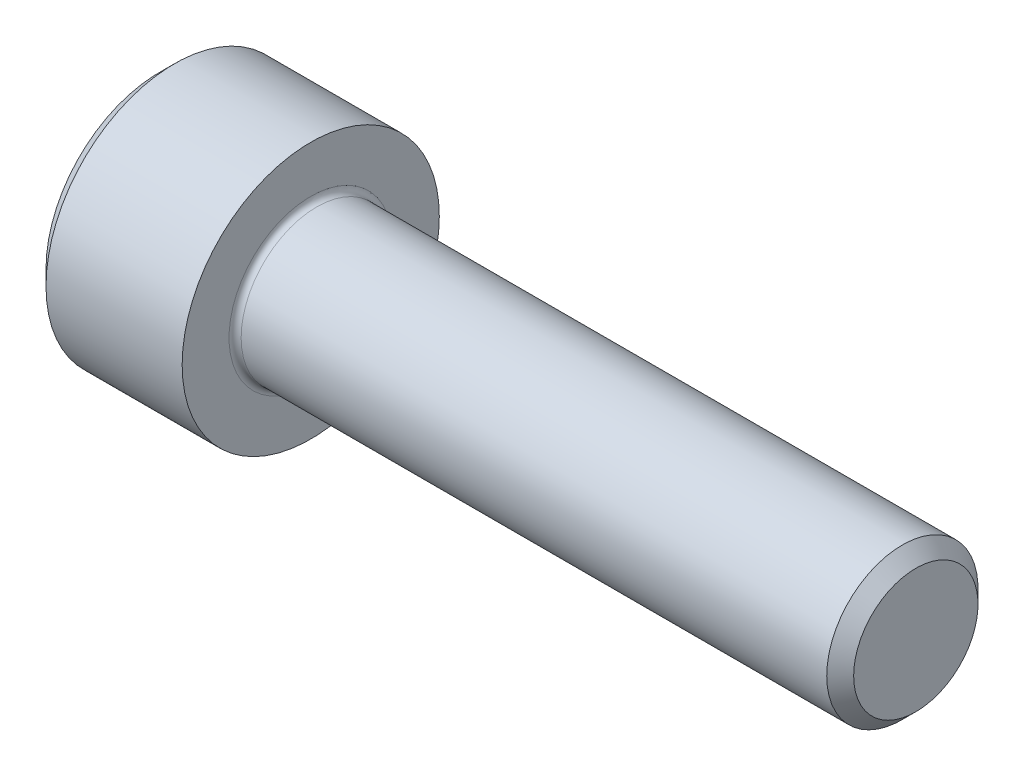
ISO-10303-21;
HEADER;
FILE_DESCRIPTION(('STEP AP214'),'2;1');
FILE_NAME('part.step','',(''),(''),'','','');
FILE_SCHEMA(('AUTOMOTIVE_DESIGN { 1 0 10303 214 1 1 1 1 }'));
ENDSEC;
DATA;
#1=APPLICATION_CONTEXT('core data for automotive mechanical design processes');
#2=APPLICATION_PROTOCOL_DEFINITION('international standard','automotive_design',2000,#1);
#3=PRODUCT_CONTEXT('',#1,'mechanical');
#4=PRODUCT('Part','Part','',(#3));
#5=PRODUCT_RELATED_PRODUCT_CATEGORY('part','',(#4));
#6=PRODUCT_DEFINITION_FORMATION('','',#4);
#7=PRODUCT_DEFINITION_CONTEXT('part definition',#1,'design');
#8=PRODUCT_DEFINITION('design','',#6,#7);
#9=PRODUCT_DEFINITION_SHAPE('','',#8);
#10=(LENGTH_UNIT() NAMED_UNIT(*) SI_UNIT(.MILLI.,.METRE.));
#11=(NAMED_UNIT(*) PLANE_ANGLE_UNIT() SI_UNIT($,.RADIAN.));
#12=(NAMED_UNIT(*) SI_UNIT($,.STERADIAN.) SOLID_ANGLE_UNIT());
#13=UNCERTAINTY_MEASURE_WITH_UNIT(LENGTH_MEASURE(1.E-05),#10,'distance_accuracy_value','');
#14=(GEOMETRIC_REPRESENTATION_CONTEXT(3) GLOBAL_UNCERTAINTY_ASSIGNED_CONTEXT((#13)) GLOBAL_UNIT_ASSIGNED_CONTEXT((#10,
#11,#12)) REPRESENTATION_CONTEXT('',''));
#15=CARTESIAN_POINT('',(0.,0.,0.));
#16=DIRECTION('',(0.,0.,1.));
#17=DIRECTION('',(1.,0.,0.));
#18=AXIS2_PLACEMENT_3D('',#15,#16,#17);
#19=CARTESIAN_POINT('',(0.,0.,0.));
#20=DIRECTION('',(-1.,0.,0.));
#21=DIRECTION('',(0.,0.,1.));
#22=AXIS2_PLACEMENT_3D('',#19,#20,#21);
#23=PLANE('',#22);
#24=DIRECTION('',(0.,-0.499999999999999,0.866025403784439));
#25=VECTOR('',#24,1.);
#26=CARTESIAN_POINT('',(0.,2.35789849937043,0.));
#27=LINE('',#26,#25);
#28=CARTESIAN_POINT('',(0.,2.35789849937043,0.));
#29=VERTEX_POINT('',#28);
#30=CARTESIAN_POINT('',(0.,1.17894924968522,2.042));
#31=VERTEX_POINT('',#30);
#32=EDGE_CURVE('E112',#29,#31,#27,.T.);
#33=ORIENTED_EDGE('',*,*,#32,.T.);
#34=DIRECTION('',(0.,1.,0.));
#35=VECTOR('',#34,1.);
#36=CARTESIAN_POINT('',(0.,-1.17894924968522,2.042));
#37=LINE('',#36,#35);
#38=CARTESIAN_POINT('',(0.,-1.17894924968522,2.042));
#39=VERTEX_POINT('',#38);
#40=EDGE_CURVE('E101',#39,#31,#37,.T.);
#41=ORIENTED_EDGE('',*,*,#40,.F.);
#42=DIRECTION('',(0.,-0.500000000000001,-0.866025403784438));
#43=VECTOR('',#42,1.);
#44=CARTESIAN_POINT('',(0.,-1.17894924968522,2.042));
#45=LINE('',#44,#43);
#46=CARTESIAN_POINT('',(0.,-2.35789849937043,0.));
#47=VERTEX_POINT('',#46);
#48=EDGE_CURVE('E111',#39,#47,#45,.T.);
#49=ORIENTED_EDGE('',*,*,#48,.T.);
#50=DIRECTION('',(0.,0.499999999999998,-0.86602540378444));
#51=VECTOR('',#50,1.);
#52=CARTESIAN_POINT('',(0.,-2.35789849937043,0.));
#53=LINE('',#52,#51);
#54=CARTESIAN_POINT('',(0.,-1.17894924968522,-2.042));
#55=VERTEX_POINT('',#54);
#56=EDGE_CURVE('E130',#47,#55,#53,.T.);
#57=ORIENTED_EDGE('',*,*,#56,.T.);
#58=DIRECTION('',(0.,-1.,0.));
#59=VECTOR('',#58,1.);
#60=CARTESIAN_POINT('',(0.,1.17894924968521,-2.042));
#61=LINE('',#60,#59);
#62=CARTESIAN_POINT('',(0.,1.17894924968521,-2.042));
#63=VERTEX_POINT('',#62);
#64=EDGE_CURVE('E133',#63,#55,#61,.T.);
#65=ORIENTED_EDGE('',*,*,#64,.F.);
#66=DIRECTION('',(0.,-0.500000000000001,-0.866025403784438));
#67=VECTOR('',#66,1.);
#68=CARTESIAN_POINT('',(0.,2.35789849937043,0.));
#69=LINE('',#68,#67);
#70=EDGE_CURVE('E126',#29,#63,#69,.T.);
#71=ORIENTED_EDGE('',*,*,#70,.F.);
#72=EDGE_LOOP('',(#33,#41,#49,#57,#65,#71));
#73=FACE_BOUND('',#72,.T.);
#74=CARTESIAN_POINT('',(0.,0.,0.));
#75=DIRECTION('',(-1.,0.,0.));
#76=DIRECTION('',(0.,0.,1.));
#77=AXIS2_PLACEMENT_3D('',#74,#75,#76);
#78=CIRCLE('',#77,3.75);
#79=CARTESIAN_POINT('',(0.,0.,3.75));
#80=VERTEX_POINT('',#79);
#81=EDGE_CURVE('E184',#80,#80,#78,.T.);
#82=ORIENTED_EDGE('',*,*,#81,.T.);
#83=EDGE_LOOP('',(#82));
#84=FACE_BOUND('',#83,.T.);
#85=ADVANCED_FACE('F30',(#73,#84),#23,.T.);
#86=CARTESIAN_POINT('',(0.,0.,0.));
#87=DIRECTION('',(1.,0.,0.));
#88=DIRECTION('',(0.,0.,-1.));
#89=AXIS2_PLACEMENT_3D('',#86,#87,#88);
#90=CONICAL_SURFACE('',#89,3.75,0.785398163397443);
#91=CARTESIAN_POINT('',(0.5,0.,0.));
#92=DIRECTION('',(-1.,0.,0.));
#93=DIRECTION('',(0.,0.,1.));
#94=AXIS2_PLACEMENT_3D('',#91,#92,#93);
#95=CIRCLE('',#94,4.25);
#96=CARTESIAN_POINT('',(0.5,0.,4.25));
#97=VERTEX_POINT('',#96);
#98=EDGE_CURVE('E181',#97,#97,#95,.T.);
#99=ORIENTED_EDGE('',*,*,#98,.T.);
#100=EDGE_LOOP('',(#99));
#101=FACE_BOUND('',#100,.T.);
#102=ORIENTED_EDGE('',*,*,#81,.F.);
#103=EDGE_LOOP('',(#102));
#104=FACE_BOUND('',#103,.T.);
#105=ADVANCED_FACE('F208',(#101,#104),#90,.T.);
#106=CARTESIAN_POINT('',(-31.75,0.,0.));
#107=DIRECTION('',(-1.,0.,0.));
#108=DIRECTION('',(0.,0.,1.));
#109=AXIS2_PLACEMENT_3D('',#106,#107,#108);
#110=CYLINDRICAL_SURFACE('',#109,4.25);
#111=CARTESIAN_POINT('',(5.,0.,0.));
#112=DIRECTION('',(-1.,0.,0.));
#113=DIRECTION('',(0.,0.,1.));
#114=AXIS2_PLACEMENT_3D('',#111,#112,#113);
#115=CIRCLE('',#114,4.25);
#116=CARTESIAN_POINT('',(5.,0.,4.25));
#117=VERTEX_POINT('',#116);
#118=EDGE_CURVE('E178',#117,#117,#115,.T.);
#119=ORIENTED_EDGE('',*,*,#118,.T.);
#120=EDGE_LOOP('',(#119));
#121=FACE_BOUND('',#120,.T.);
#122=ORIENTED_EDGE('',*,*,#98,.F.);
#123=EDGE_LOOP('',(#122));
#124=FACE_BOUND('',#123,.T.);
#125=ADVANCED_FACE('F212',(#121,#124),#110,.T.);
#126=CARTESIAN_POINT('',(5.,4.25,0.));
#127=DIRECTION('',(1.,0.,0.));
#128=DIRECTION('',(0.,0.,-1.));
#129=AXIS2_PLACEMENT_3D('',#126,#127,#128);
#130=PLANE('',#129);
#131=CARTESIAN_POINT('',(5.,0.,0.));
#132=DIRECTION('',(1.,0.,0.));
#133=DIRECTION('',(0.,0.,-1.));
#134=AXIS2_PLACEMENT_3D('',#131,#132,#133);
#135=CIRCLE('',#134,2.7);
#136=CARTESIAN_POINT('',(5.,0.,-2.7));
#137=VERTEX_POINT('',#136);
#138=EDGE_CURVE('E37',#137,#137,#135,.F.);
#139=ORIENTED_EDGE('',*,*,#138,.T.);
#140=EDGE_LOOP('',(#139));
#141=FACE_BOUND('',#140,.T.);
#142=ORIENTED_EDGE('',*,*,#118,.F.);
#143=EDGE_LOOP('',(#142));
#144=FACE_BOUND('',#143,.T.);
#145=ADVANCED_FACE('F189',(#141,#144),#130,.T.);
#146=CARTESIAN_POINT('',(-31.75,0.,0.));
#147=DIRECTION('',(-1.,0.,0.));
#148=DIRECTION('',(0.,0.,1.));
#149=AXIS2_PLACEMENT_3D('',#146,#147,#148);
#150=CYLINDRICAL_SURFACE('',#149,2.5);
#151=CARTESIAN_POINT('',(5.2,0.,0.));
#152=DIRECTION('',(1.,0.,0.));
#153=DIRECTION('',(0.,0.,-1.));
#154=AXIS2_PLACEMENT_3D('',#151,#152,#153);
#155=CIRCLE('',#154,2.5);
#156=CARTESIAN_POINT('',(5.2,0.,-2.5));
#157=VERTEX_POINT('',#156);
#158=EDGE_CURVE('E11',#157,#157,#155,.T.);
#159=ORIENTED_EDGE('',*,*,#158,.T.);
#160=EDGE_LOOP('',(#159));
#161=FACE_BOUND('',#160,.T.);
#162=CARTESIAN_POINT('',(24.555,0.,0.));
#163=DIRECTION('',(-1.,0.,0.));
#164=DIRECTION('',(0.,0.,1.));
#165=AXIS2_PLACEMENT_3D('',#162,#163,#164);
#166=CIRCLE('',#165,2.5);
#167=CARTESIAN_POINT('',(24.555,0.,2.5));
#168=VERTEX_POINT('',#167);
#169=EDGE_CURVE('E175',#168,#168,#166,.T.);
#170=ORIENTED_EDGE('',*,*,#169,.T.);
#171=EDGE_LOOP('',(#170));
#172=FACE_BOUND('',#171,.T.);
#173=ADVANCED_FACE('F223',(#161,#172),#150,.T.);
#174=CARTESIAN_POINT('',(25.,0.,0.));
#175=DIRECTION('',(-1.,0.,0.));
#176=DIRECTION('',(0.,0.,1.));
#177=AXIS2_PLACEMENT_3D('',#174,#175,#176);
#178=CONICAL_SURFACE('',#177,2.055,0.785398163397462);
#179=ORIENTED_EDGE('',*,*,#169,.F.);
#180=EDGE_LOOP('',(#179));
#181=FACE_BOUND('',#180,.T.);
#182=CARTESIAN_POINT('',(25.,0.,0.));
#183=DIRECTION('',(-1.,0.,0.));
#184=DIRECTION('',(0.,0.,1.));
#185=AXIS2_PLACEMENT_3D('',#182,#183,#184);
#186=CIRCLE('',#185,2.055);
#187=CARTESIAN_POINT('',(25.,0.,2.055));
#188=VERTEX_POINT('',#187);
#189=EDGE_CURVE('E171',#188,#188,#186,.T.);
#190=ORIENTED_EDGE('',*,*,#189,.T.);
#191=EDGE_LOOP('',(#190));
#192=FACE_BOUND('',#191,.T.);
#193=ADVANCED_FACE('F202',(#181,#192),#178,.T.);
#194=CARTESIAN_POINT('',(25.,2.055,0.));
#195=DIRECTION('',(1.,0.,0.));
#196=DIRECTION('',(0.,0.,-1.));
#197=AXIS2_PLACEMENT_3D('',#194,#195,#196);
#198=PLANE('',#197);
#199=ORIENTED_EDGE('',*,*,#189,.F.);
#200=EDGE_LOOP('',(#199));
#201=FACE_BOUND('',#200,.T.);
#202=ADVANCED_FACE('F194',(#201),#198,.T.);
#203=CARTESIAN_POINT('',(5.2,0.,0.));
#204=DIRECTION('',(1.,0.,0.));
#205=DIRECTION('',(0.,0.,-1.));
#206=AXIS2_PLACEMENT_3D('',#203,#204,#205);
#207=TOROIDAL_SURFACE('',#206,2.7,0.2);
#208=ORIENTED_EDGE('',*,*,#158,.F.);
#209=EDGE_LOOP('',(#208));
#210=FACE_BOUND('',#209,.T.);
#211=ORIENTED_EDGE('',*,*,#138,.F.);
#212=EDGE_LOOP('',(#211));
#213=FACE_BOUND('',#212,.T.);
#214=ADVANCED_FACE('F192',(#210,#213),#207,.F.);
#215=CARTESIAN_POINT('',(2.5,2.35789849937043,0.));
#216=DIRECTION('',(0.,-0.866025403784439,-0.499999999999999));
#217=DIRECTION('',(0.,0.499999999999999,-0.866025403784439));
#218=AXIS2_PLACEMENT_3D('',#215,#216,#217);
#219=PLANE('',#218);
#220=ORIENTED_EDGE('',*,*,#32,.F.);
#221=DIRECTION('',(-1.,0.,0.));
#222=VECTOR('',#221,1.);
#223=CARTESIAN_POINT('',(2.5,2.35789849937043,0.));
#224=LINE('',#223,#222);
#225=CARTESIAN_POINT('',(2.5,2.35789849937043,0.));
#226=VERTEX_POINT('',#225);
#227=EDGE_CURVE('E156',#226,#29,#224,.T.);
#228=ORIENTED_EDGE('',*,*,#227,.F.);
#229=DIRECTION('',(0.,-0.499999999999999,0.866025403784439));
#230=VECTOR('',#229,1.);
#231=CARTESIAN_POINT('',(2.5,2.35789849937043,0.));
#232=LINE('',#231,#230);
#233=CARTESIAN_POINT('',(2.5,1.76842387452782,1.021));
#234=VERTEX_POINT('',#233);
#235=EDGE_CURVE('E136',#226,#234,#232,.T.);
#236=ORIENTED_EDGE('',*,*,#235,.T.);
#237=CARTESIAN_POINT('',(2.5,1.17894924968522,2.042));
#238=VERTEX_POINT('',#237);
#239=EDGE_CURVE('E120',#234,#238,#232,.T.);
#240=ORIENTED_EDGE('',*,*,#239,.T.);
#241=DIRECTION('',(-1.,0.,0.));
#242=VECTOR('',#241,1.);
#243=CARTESIAN_POINT('',(2.5,1.17894924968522,2.042));
#244=LINE('',#243,#242);
#245=EDGE_CURVE('E105',#238,#31,#244,.T.);
#246=ORIENTED_EDGE('',*,*,#245,.T.);
#247=EDGE_LOOP('',(#220,#228,#236,#240,#246));
#248=FACE_BOUND('',#247,.T.);
#249=ADVANCED_FACE('F116',(#248),#219,.T.);
#250=CARTESIAN_POINT('',(2.5,-1.17894924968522,2.042));
#251=DIRECTION('',(0.,0.,1.));
#252=DIRECTION('',(0.,-1.,0.));
#253=AXIS2_PLACEMENT_3D('',#250,#251,#252);
#254=PLANE('',#253);
#255=ORIENTED_EDGE('',*,*,#40,.T.);
#256=ORIENTED_EDGE('',*,*,#245,.F.);
#257=DIRECTION('',(0.,1.,0.));
#258=VECTOR('',#257,1.);
#259=CARTESIAN_POINT('',(2.5,-1.17894924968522,2.042));
#260=LINE('',#259,#258);
#261=CARTESIAN_POINT('',(2.5,0.,2.042));
#262=VERTEX_POINT('',#261);
#263=EDGE_CURVE('E138',#262,#238,#260,.T.);
#264=ORIENTED_EDGE('',*,*,#263,.F.);
#265=CARTESIAN_POINT('',(2.5,-1.17894924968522,2.042));
#266=VERTEX_POINT('',#265);
#267=EDGE_CURVE('E139',#266,#262,#260,.T.);
#268=ORIENTED_EDGE('',*,*,#267,.F.);
#269=DIRECTION('',(-1.,0.,0.));
#270=VECTOR('',#269,1.);
#271=CARTESIAN_POINT('',(2.5,-1.17894924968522,2.042));
#272=LINE('',#271,#270);
#273=EDGE_CURVE('E107',#266,#39,#272,.T.);
#274=ORIENTED_EDGE('',*,*,#273,.T.);
#275=EDGE_LOOP('',(#255,#256,#264,#268,#274));
#276=FACE_BOUND('',#275,.T.);
#277=ADVANCED_FACE('F103',(#276),#254,.F.);
#278=CARTESIAN_POINT('',(2.5,-1.17894924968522,2.042));
#279=DIRECTION('',(0.,0.866025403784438,-0.500000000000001));
#280=DIRECTION('',(0.,0.500000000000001,0.866025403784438));
#281=AXIS2_PLACEMENT_3D('',#278,#279,#280);
#282=PLANE('',#281);
#283=ORIENTED_EDGE('',*,*,#48,.F.);
#284=ORIENTED_EDGE('',*,*,#273,.F.);
#285=DIRECTION('',(0.,-0.500000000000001,-0.866025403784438));
#286=VECTOR('',#285,1.);
#287=CARTESIAN_POINT('',(2.5,-1.17894924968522,2.042));
#288=LINE('',#287,#286);
#289=CARTESIAN_POINT('',(2.5,-1.76842387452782,1.021));
#290=VERTEX_POINT('',#289);
#291=EDGE_CURVE('E143',#266,#290,#288,.T.);
#292=ORIENTED_EDGE('',*,*,#291,.T.);
#293=CARTESIAN_POINT('',(2.5,-2.35789849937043,0.));
#294=VERTEX_POINT('',#293);
#295=EDGE_CURVE('E142',#290,#294,#288,.T.);
#296=ORIENTED_EDGE('',*,*,#295,.T.);
#297=DIRECTION('',(-1.,0.,0.));
#298=VECTOR('',#297,1.);
#299=CARTESIAN_POINT('',(2.5,-2.35789849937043,0.));
#300=LINE('',#299,#298);
#301=EDGE_CURVE('E164',#294,#47,#300,.T.);
#302=ORIENTED_EDGE('',*,*,#301,.T.);
#303=EDGE_LOOP('',(#283,#284,#292,#296,#302));
#304=FACE_BOUND('',#303,.T.);
#305=ADVANCED_FACE('F277',(#304),#282,.T.);
#306=CARTESIAN_POINT('',(2.5,-2.35789849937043,0.));
#307=DIRECTION('',(0.,0.86602540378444,0.499999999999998));
#308=DIRECTION('',(0.,-0.499999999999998,0.86602540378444));
#309=AXIS2_PLACEMENT_3D('',#306,#307,#308);
#310=PLANE('',#309);
#311=ORIENTED_EDGE('',*,*,#56,.F.);
#312=ORIENTED_EDGE('',*,*,#301,.F.);
#313=DIRECTION('',(0.,0.499999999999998,-0.86602540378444));
#314=VECTOR('',#313,1.);
#315=CARTESIAN_POINT('',(2.5,-2.35789849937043,0.));
#316=LINE('',#315,#314);
#317=CARTESIAN_POINT('',(2.5,-1.76842387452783,-1.021));
#318=VERTEX_POINT('',#317);
#319=EDGE_CURVE('E147',#294,#318,#316,.T.);
#320=ORIENTED_EDGE('',*,*,#319,.T.);
#321=CARTESIAN_POINT('',(2.5,-1.17894924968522,-2.042));
#322=VERTEX_POINT('',#321);
#323=EDGE_CURVE('E146',#318,#322,#316,.T.);
#324=ORIENTED_EDGE('',*,*,#323,.T.);
#325=DIRECTION('',(-1.,0.,0.));
#326=VECTOR('',#325,1.);
#327=CARTESIAN_POINT('',(2.5,-1.17894924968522,-2.042));
#328=LINE('',#327,#326);
#329=EDGE_CURVE('E161',#322,#55,#328,.T.);
#330=ORIENTED_EDGE('',*,*,#329,.T.);
#331=EDGE_LOOP('',(#311,#312,#320,#324,#330));
#332=FACE_BOUND('',#331,.T.);
#333=ADVANCED_FACE('F286',(#332),#310,.T.);
#334=CARTESIAN_POINT('',(2.5,1.17894924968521,-2.042));
#335=DIRECTION('',(0.,0.,-1.));
#336=DIRECTION('',(0.,1.,0.));
#337=AXIS2_PLACEMENT_3D('',#334,#335,#336);
#338=PLANE('',#337);
#339=ORIENTED_EDGE('',*,*,#64,.T.);
#340=ORIENTED_EDGE('',*,*,#329,.F.);
#341=DIRECTION('',(0.,-1.,0.));
#342=VECTOR('',#341,1.);
#343=CARTESIAN_POINT('',(2.5,1.17894924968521,-2.042));
#344=LINE('',#343,#342);
#345=CARTESIAN_POINT('',(2.5,0.,-2.042));
#346=VERTEX_POINT('',#345);
#347=EDGE_CURVE('E150',#346,#322,#344,.T.);
#348=ORIENTED_EDGE('',*,*,#347,.F.);
#349=CARTESIAN_POINT('',(2.5,1.17894924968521,-2.042));
#350=VERTEX_POINT('',#349);
#351=EDGE_CURVE('E44',#350,#346,#344,.T.);
#352=ORIENTED_EDGE('',*,*,#351,.F.);
#353=DIRECTION('',(-1.,0.,0.));
#354=VECTOR('',#353,1.);
#355=CARTESIAN_POINT('',(2.5,1.17894924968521,-2.042));
#356=LINE('',#355,#354);
#357=EDGE_CURVE('E158',#350,#63,#356,.T.);
#358=ORIENTED_EDGE('',*,*,#357,.T.);
#359=EDGE_LOOP('',(#339,#340,#348,#352,#358));
#360=FACE_BOUND('',#359,.T.);
#361=ADVANCED_FACE('F296',(#360),#338,.F.);
#362=CARTESIAN_POINT('',(2.5,2.35789849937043,0.));
#363=DIRECTION('',(0.,0.866025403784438,-0.500000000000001));
#364=DIRECTION('',(0.,0.500000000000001,0.866025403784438));
#365=AXIS2_PLACEMENT_3D('',#362,#363,#364);
#366=PLANE('',#365);
#367=ORIENTED_EDGE('',*,*,#70,.T.);
#368=ORIENTED_EDGE('',*,*,#357,.F.);
#369=DIRECTION('',(0.,-0.500000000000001,-0.866025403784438));
#370=VECTOR('',#369,1.);
#371=CARTESIAN_POINT('',(2.5,2.35789849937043,0.));
#372=LINE('',#371,#370);
#373=CARTESIAN_POINT('',(2.5,1.76842387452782,-1.021));
#374=VERTEX_POINT('',#373);
#375=EDGE_CURVE('E152',#374,#350,#372,.T.);
#376=ORIENTED_EDGE('',*,*,#375,.F.);
#377=EDGE_CURVE('E153',#226,#374,#372,.T.);
#378=ORIENTED_EDGE('',*,*,#377,.F.);
#379=ORIENTED_EDGE('',*,*,#227,.T.);
#380=EDGE_LOOP('',(#367,#368,#376,#378,#379));
#381=FACE_BOUND('',#380,.T.);
#382=ADVANCED_FACE('F306',(#381),#366,.F.);
#383=CARTESIAN_POINT('',(2.5,3.53684774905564,-2.04200000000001));
#384=DIRECTION('',(1.,0.,0.));
#385=DIRECTION('',(0.,0.,-1.));
#386=AXIS2_PLACEMENT_3D('',#383,#384,#385);
#387=PLANE('',#386);
#388=ORIENTED_EDGE('',*,*,#347,.T.);
#389=ORIENTED_EDGE('',*,*,#323,.F.);
#390=CARTESIAN_POINT('',(2.5,0.,0.));
#391=DIRECTION('',(-1.,0.,0.));
#392=DIRECTION('',(0.,0.,1.));
#393=AXIS2_PLACEMENT_3D('',#390,#391,#392);
#394=CIRCLE('',#393,2.042);
#395=EDGE_CURVE('E392',#346,#318,#394,.T.);
#396=ORIENTED_EDGE('',*,*,#395,.F.);
#397=EDGE_LOOP('',(#388,#389,#396));
#398=FACE_BOUND('',#397,.T.);
#399=ADVANCED_FACE('F316',(#398),#387,.F.);
#400=ORIENTED_EDGE('',*,*,#319,.F.);
#401=ORIENTED_EDGE('',*,*,#295,.F.);
#402=EDGE_CURVE('E390',#318,#290,#394,.T.);
#403=ORIENTED_EDGE('',*,*,#402,.F.);
#404=EDGE_LOOP('',(#400,#401,#403));
#405=FACE_BOUND('',#404,.T.);
#406=ADVANCED_FACE('F326',(#405),#387,.F.);
#407=ORIENTED_EDGE('',*,*,#291,.F.);
#408=ORIENTED_EDGE('',*,*,#267,.T.);
#409=EDGE_CURVE('E121',#290,#262,#394,.T.);
#410=ORIENTED_EDGE('',*,*,#409,.F.);
#411=EDGE_LOOP('',(#407,#408,#410));
#412=FACE_BOUND('',#411,.T.);
#413=ADVANCED_FACE('F337',(#412),#387,.F.);
#414=ORIENTED_EDGE('',*,*,#263,.T.);
#415=ORIENTED_EDGE('',*,*,#239,.F.);
#416=EDGE_CURVE('E168',#262,#234,#394,.T.);
#417=ORIENTED_EDGE('',*,*,#416,.F.);
#418=EDGE_LOOP('',(#414,#415,#417));
#419=FACE_BOUND('',#418,.T.);
#420=ADVANCED_FACE('F346',(#419),#387,.F.);
#421=ORIENTED_EDGE('',*,*,#235,.F.);
#422=ORIENTED_EDGE('',*,*,#377,.T.);
#423=EDGE_CURVE('E172',#234,#374,#394,.T.);
#424=ORIENTED_EDGE('',*,*,#423,.F.);
#425=EDGE_LOOP('',(#421,#422,#424));
#426=FACE_BOUND('',#425,.T.);
#427=ADVANCED_FACE('F355',(#426),#387,.F.);
#428=ORIENTED_EDGE('',*,*,#375,.T.);
#429=ORIENTED_EDGE('',*,*,#351,.T.);
#430=EDGE_CURVE('E395',#374,#346,#394,.T.);
#431=ORIENTED_EDGE('',*,*,#430,.F.);
#432=EDGE_LOOP('',(#428,#429,#431));
#433=FACE_BOUND('',#432,.T.);
#434=ADVANCED_FACE('F329',(#433),#387,.F.);
#435=CARTESIAN_POINT('',(2.5,0.,0.));
#436=DIRECTION('',(-1.,0.,0.));
#437=DIRECTION('',(0.,0.,1.));
#438=AXIS2_PLACEMENT_3D('',#435,#436,#437);
#439=CONICAL_SURFACE('',#438,2.042,1.04719755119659);
#440=CARTESIAN_POINT('',(3.67894924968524,0.,0.));
#441=VERTEX_POINT('',#440);
#442=VERTEX_LOOP('',#441);
#443=FACE_BOUND('',#442,.T.);
#444=ORIENTED_EDGE('',*,*,#416,.T.);
#445=ORIENTED_EDGE('',*,*,#423,.T.);
#446=ORIENTED_EDGE('',*,*,#430,.T.);
#447=ORIENTED_EDGE('',*,*,#395,.T.);
#448=ORIENTED_EDGE('',*,*,#402,.T.);
#449=ORIENTED_EDGE('',*,*,#409,.T.);
#450=EDGE_LOOP('',(#444,#445,#446,#447,#448,#449));
#451=FACE_BOUND('',#450,.T.);
#452=ADVANCED_FACE('F372',(#443,#451),#439,.F.);
#453=CLOSED_SHELL('',(#85,#105,#125,#145,#173,#193,#202,#214,#249,#277,#305,#333,#361,#382,#399,
#406,#413,#420,#427,#434,#452));
#454=MANIFOLD_SOLID_BREP('B2',#453);
#455=ADVANCED_BREP_SHAPE_REPRESENTATION('',(#18,#454),#14);
#456=SHAPE_DEFINITION_REPRESENTATION(#9,#455);
ENDSEC;
END-ISO-10303-21;
